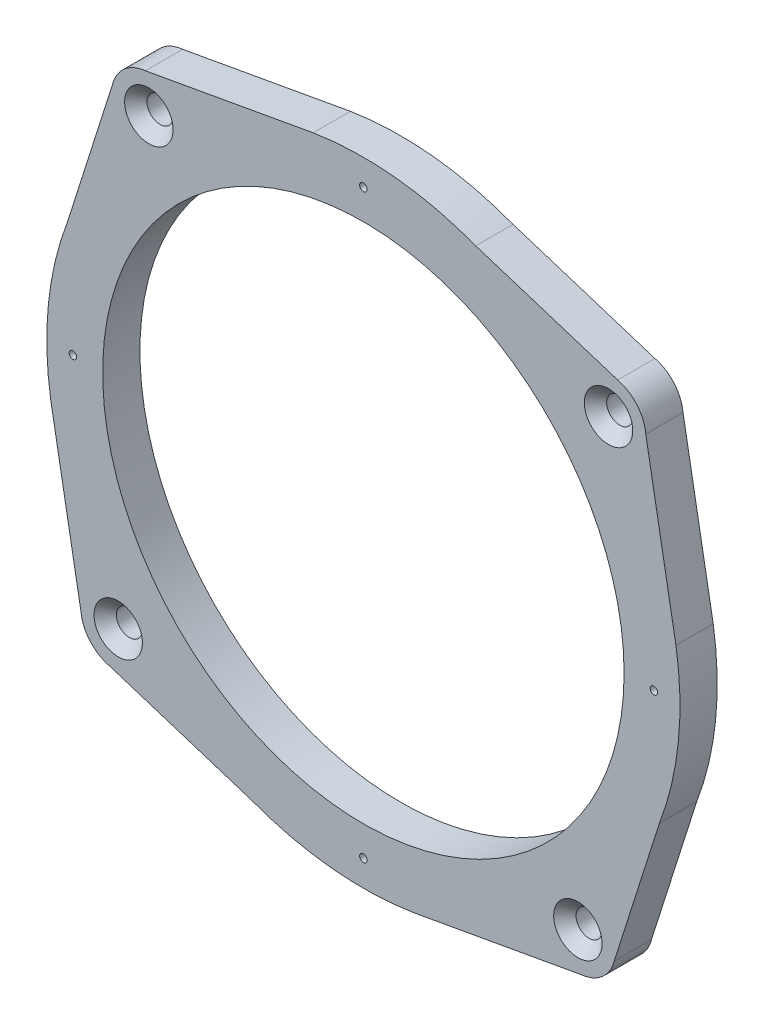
ISO-10303-21;
HEADER;
FILE_DESCRIPTION(('STEP AP214'),'2;1');
FILE_NAME('part.step','',(''),(''),'','','');
FILE_SCHEMA(('AUTOMOTIVE_DESIGN { 1 0 10303 214 1 1 1 1 }'));
ENDSEC;
DATA;
#1=APPLICATION_CONTEXT('core data for automotive mechanical design processes');
#2=APPLICATION_PROTOCOL_DEFINITION('international standard','automotive_design',2000,#1);
#3=PRODUCT_CONTEXT('',#1,'mechanical');
#4=PRODUCT('Part','Part','',(#3));
#5=PRODUCT_RELATED_PRODUCT_CATEGORY('part','',(#4));
#6=PRODUCT_DEFINITION_FORMATION('','',#4);
#7=PRODUCT_DEFINITION_CONTEXT('part definition',#1,'design');
#8=PRODUCT_DEFINITION('design','',#6,#7);
#9=PRODUCT_DEFINITION_SHAPE('','',#8);
#10=(LENGTH_UNIT() NAMED_UNIT(*) SI_UNIT(.MILLI.,.METRE.));
#11=(NAMED_UNIT(*) PLANE_ANGLE_UNIT() SI_UNIT($,.RADIAN.));
#12=(NAMED_UNIT(*) SI_UNIT($,.STERADIAN.) SOLID_ANGLE_UNIT());
#13=UNCERTAINTY_MEASURE_WITH_UNIT(LENGTH_MEASURE(1.E-05),#10,'distance_accuracy_value','');
#14=(GEOMETRIC_REPRESENTATION_CONTEXT(3) GLOBAL_UNCERTAINTY_ASSIGNED_CONTEXT((#13)) GLOBAL_UNIT_ASSIGNED_CONTEXT((#10,
#11,#12)) REPRESENTATION_CONTEXT('',''));
#15=CARTESIAN_POINT('',(0.,0.,0.));
#16=DIRECTION('',(0.,0.,1.));
#17=DIRECTION('',(1.,0.,0.));
#18=AXIS2_PLACEMENT_3D('',#15,#16,#17);
#19=CARTESIAN_POINT('',(533.734635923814,316.449701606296,10.));
#20=DIRECTION('',(0.,0.,-1.));
#21=DIRECTION('',(-1.,0.,0.));
#22=AXIS2_PLACEMENT_3D('',#19,#20,#21);
#23=CYLINDRICAL_SURFACE('',#22,85.0000000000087);
#24=CARTESIAN_POINT('',(533.734635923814,316.449701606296,0.));
#25=DIRECTION('',(0.,0.,1.));
#26=DIRECTION('',(1.,0.,0.));
#27=AXIS2_PLACEMENT_3D('',#24,#25,#26);
#28=CIRCLE('',#27,85.0000000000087);
#29=CARTESIAN_POINT('',(613.19653596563,286.270131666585,0.));
#30=VERTEX_POINT('',#29);
#31=CARTESIAN_POINT('',(617.658730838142,329.931032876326,0.));
#32=VERTEX_POINT('',#31);
#33=EDGE_CURVE('E217',#30,#32,#28,.T.);
#34=ORIENTED_EDGE('',*,*,#33,.T.);
#35=DIRECTION('',(0.,0.,-1.));
#36=VECTOR('',#35,1.);
#37=CARTESIAN_POINT('',(617.658730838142,329.931032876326,10.));
#38=LINE('',#37,#36);
#39=CARTESIAN_POINT('',(617.658730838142,329.931032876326,10.));
#40=VERTEX_POINT('',#39);
#41=EDGE_CURVE('E343',#40,#32,#38,.T.);
#42=ORIENTED_EDGE('',*,*,#41,.F.);
#43=CARTESIAN_POINT('',(533.734635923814,316.449701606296,10.));
#44=DIRECTION('',(0.,0.,1.));
#45=DIRECTION('',(1.,0.,0.));
#46=AXIS2_PLACEMENT_3D('',#43,#44,#45);
#47=CIRCLE('',#46,85.0000000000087);
#48=CARTESIAN_POINT('',(613.19653596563,286.270131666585,10.));
#49=VERTEX_POINT('',#48);
#50=EDGE_CURVE('E126',#49,#40,#47,.T.);
#51=ORIENTED_EDGE('',*,*,#50,.F.);
#52=DIRECTION('',(0.,0.,-1.));
#53=VECTOR('',#52,1.);
#54=CARTESIAN_POINT('',(613.19653596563,286.270131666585,10.));
#55=LINE('',#54,#53);
#56=EDGE_CURVE('E208',#49,#30,#55,.T.);
#57=ORIENTED_EDGE('',*,*,#56,.T.);
#58=EDGE_LOOP('',(#34,#42,#51,#57));
#59=FACE_BOUND('',#58,.T.);
#60=ADVANCED_FACE('F43',(#59),#23,.T.);
#61=CARTESIAN_POINT('',(655.77924584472,117.901952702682,10.));
#62=DIRECTION('',(0.984219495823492,0.17695192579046,0.));
#63=DIRECTION('',(-0.17695192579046,0.984219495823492,0.));
#64=AXIS2_PLACEMENT_3D('',#61,#62,#63);
#65=PLANE('',#64);
#66=DIRECTION('',(0.17695192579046,-0.984219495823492,0.));
#67=VECTOR('',#66,1.);
#68=CARTESIAN_POINT('',(655.77924584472,117.901952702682,0.));
#69=LINE('',#68,#67);
#70=CARTESIAN_POINT('',(609.5578781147,374.988565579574,0.));
#71=VERTEX_POINT('',#70);
#72=EDGE_CURVE('E221',#71,#32,#69,.T.);
#73=ORIENTED_EDGE('',*,*,#72,.F.);
#74=DIRECTION('',(0.,0.,-1.));
#75=VECTOR('',#74,1.);
#76=CARTESIAN_POINT('',(609.5578781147,374.988565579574,10.));
#77=LINE('',#76,#75);
#78=CARTESIAN_POINT('',(609.5578781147,374.988565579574,10.));
#79=VERTEX_POINT('',#78);
#80=EDGE_CURVE('E340',#79,#71,#77,.T.);
#81=ORIENTED_EDGE('',*,*,#80,.F.);
#82=DIRECTION('',(0.17695192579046,-0.984219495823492,0.));
#83=VECTOR('',#82,1.);
#84=CARTESIAN_POINT('',(655.77924584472,117.901952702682,10.));
#85=LINE('',#84,#83);
#86=EDGE_CURVE('E572',#79,#40,#85,.T.);
#87=ORIENTED_EDGE('',*,*,#86,.T.);
#88=ORIENTED_EDGE('',*,*,#41,.T.);
#89=EDGE_LOOP('',(#73,#81,#87,#88));
#90=FACE_BOUND('',#89,.T.);
#91=ADVANCED_FACE('F391',(#90),#65,.T.);
#92=CARTESIAN_POINT('',(599.554614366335,374.044755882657,10.));
#93=DIRECTION('',(0.,0.,-1.));
#94=DIRECTION('',(-1.,0.,0.));
#95=AXIS2_PLACEMENT_3D('',#92,#93,#94);
#96=CYLINDRICAL_SURFACE('',#95,10.0476894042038);
#97=CARTESIAN_POINT('',(599.554614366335,374.044755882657,0.));
#98=DIRECTION('',(0.,0.,1.));
#99=DIRECTION('',(1.,0.,0.));
#100=AXIS2_PLACEMENT_3D('',#97,#98,#99);
#101=CIRCLE('',#100,10.0476894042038);
#102=CARTESIAN_POINT('',(602.01723134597,383.785986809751,0.));
#103=VERTEX_POINT('',#102);
#104=EDGE_CURVE('E225',#71,#103,#101,.T.);
#105=ORIENTED_EDGE('',*,*,#104,.T.);
#106=DIRECTION('',(0.,0.,-1.));
#107=VECTOR('',#106,1.);
#108=CARTESIAN_POINT('',(602.01723134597,383.785986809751,10.));
#109=LINE('',#108,#107);
#110=CARTESIAN_POINT('',(602.01723134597,383.785986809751,10.));
#111=VERTEX_POINT('',#110);
#112=EDGE_CURVE('E336',#111,#103,#109,.T.);
#113=ORIENTED_EDGE('',*,*,#112,.F.);
#114=CARTESIAN_POINT('',(599.554614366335,374.044755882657,10.));
#115=DIRECTION('',(0.,0.,1.));
#116=DIRECTION('',(1.,0.,0.));
#117=AXIS2_PLACEMENT_3D('',#114,#115,#116);
#118=CIRCLE('',#117,10.0476894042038);
#119=EDGE_CURVE('E544',#79,#111,#118,.T.);
#120=ORIENTED_EDGE('',*,*,#119,.F.);
#121=ORIENTED_EDGE('',*,*,#80,.T.);
#122=EDGE_LOOP('',(#105,#113,#120,#121));
#123=FACE_BOUND('',#122,.T.);
#124=ADVANCED_FACE('F397',(#123),#96,.T.);
#125=CARTESIAN_POINT('',(166.262759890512,522.457150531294,10.));
#126=DIRECTION('',(-0.303247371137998,-0.952911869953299,0.));
#127=DIRECTION('',(0.952911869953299,-0.303247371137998,0.));
#128=AXIS2_PLACEMENT_3D('',#125,#126,#127);
#129=PLANE('',#128);
#130=DIRECTION('',(-0.952911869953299,0.303247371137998,0.));
#131=VECTOR('',#130,1.);
#132=CARTESIAN_POINT('',(166.262759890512,522.457150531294,0.));
#133=LINE('',#132,#131);
#134=CARTESIAN_POINT('',(563.914205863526,395.911601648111,0.));
#135=VERTEX_POINT('',#134);
#136=EDGE_CURVE('E228',#103,#135,#133,.T.);
#137=ORIENTED_EDGE('',*,*,#136,.T.);
#138=DIRECTION('',(0.,0.,-1.));
#139=VECTOR('',#138,1.);
#140=CARTESIAN_POINT('',(563.914205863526,395.911601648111,10.));
#141=LINE('',#140,#139);
#142=CARTESIAN_POINT('',(563.914205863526,395.911601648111,10.));
#143=VERTEX_POINT('',#142);
#144=EDGE_CURVE('E332',#143,#135,#141,.T.);
#145=ORIENTED_EDGE('',*,*,#144,.F.);
#146=DIRECTION('',(-0.952911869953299,0.303247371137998,0.));
#147=VECTOR('',#146,1.);
#148=CARTESIAN_POINT('',(166.262759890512,522.457150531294,10.));
#149=LINE('',#148,#147);
#150=EDGE_CURVE('E526',#111,#143,#149,.T.);
#151=ORIENTED_EDGE('',*,*,#150,.F.);
#152=ORIENTED_EDGE('',*,*,#112,.T.);
#153=EDGE_LOOP('',(#137,#145,#151,#152));
#154=FACE_BOUND('',#153,.T.);
#155=ADVANCED_FACE('F510',(#154),#129,.F.);
#156=CARTESIAN_POINT('',(533.734635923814,316.449701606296,10.));
#157=DIRECTION('',(0.,0.,-1.));
#158=DIRECTION('',(-1.,0.,0.));
#159=AXIS2_PLACEMENT_3D('',#156,#157,#158);
#160=CYLINDRICAL_SURFACE('',#159,85.0000000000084);
#161=CARTESIAN_POINT('',(533.734635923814,316.449701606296,0.));
#162=DIRECTION('',(0.,0.,1.));
#163=DIRECTION('',(1.,0.,0.));
#164=AXIS2_PLACEMENT_3D('',#161,#162,#163);
#165=CIRCLE('',#164,85.0000000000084);
#166=CARTESIAN_POINT('',(520.253304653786,400.373796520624,0.));
#167=VERTEX_POINT('',#166);
#168=EDGE_CURVE('E231',#135,#167,#165,.T.);
#169=ORIENTED_EDGE('',*,*,#168,.T.);
#170=DIRECTION('',(0.,0.,-1.));
#171=VECTOR('',#170,1.);
#172=CARTESIAN_POINT('',(520.253304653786,400.373796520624,10.));
#173=LINE('',#172,#171);
#174=CARTESIAN_POINT('',(520.253304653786,400.373796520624,10.));
#175=VERTEX_POINT('',#174);
#176=EDGE_CURVE('E329',#175,#167,#173,.T.);
#177=ORIENTED_EDGE('',*,*,#176,.F.);
#178=CARTESIAN_POINT('',(533.734635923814,316.449701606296,10.));
#179=DIRECTION('',(0.,0.,1.));
#180=DIRECTION('',(1.,0.,0.));
#181=AXIS2_PLACEMENT_3D('',#178,#179,#180);
#182=CIRCLE('',#181,85.0000000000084);
#183=EDGE_CURVE('E535',#143,#175,#182,.T.);
#184=ORIENTED_EDGE('',*,*,#183,.F.);
#185=ORIENTED_EDGE('',*,*,#144,.T.);
#186=EDGE_LOOP('',(#169,#177,#184,#185));
#187=FACE_BOUND('',#186,.T.);
#188=ADVANCED_FACE('F506',(#187),#160,.T.);
#189=CARTESIAN_POINT('',(-53.4387511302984,297.230224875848,10.));
#190=DIRECTION('',(-0.176951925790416,0.984219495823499,0.));
#191=DIRECTION('',(-0.984219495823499,-0.176951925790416,0.));
#192=AXIS2_PLACEMENT_3D('',#189,#190,#191);
#193=PLANE('',#192);
#194=DIRECTION('',(0.984219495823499,0.176951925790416,0.));
#195=VECTOR('',#194,1.);
#196=CARTESIAN_POINT('',(-53.4387511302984,297.230224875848,0.));
#197=LINE('',#196,#195);
#198=CARTESIAN_POINT('',(475.195771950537,392.272943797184,0.));
#199=VERTEX_POINT('',#198);
#200=EDGE_CURVE('E235',#199,#167,#197,.T.);
#201=ORIENTED_EDGE('',*,*,#200,.F.);
#202=DIRECTION('',(0.,0.,-1.));
#203=VECTOR('',#202,1.);
#204=CARTESIAN_POINT('',(475.195771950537,392.272943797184,10.));
#205=LINE('',#204,#203);
#206=CARTESIAN_POINT('',(475.195771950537,392.272943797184,10.));
#207=VERTEX_POINT('',#206);
#208=EDGE_CURVE('E326',#207,#199,#205,.T.);
#209=ORIENTED_EDGE('',*,*,#208,.F.);
#210=DIRECTION('',(0.984219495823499,0.176951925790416,0.));
#211=VECTOR('',#210,1.);
#212=CARTESIAN_POINT('',(-53.4387511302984,297.230224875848,10.));
#213=LINE('',#212,#211);
#214=EDGE_CURVE('E538',#207,#175,#213,.T.);
#215=ORIENTED_EDGE('',*,*,#214,.T.);
#216=ORIENTED_EDGE('',*,*,#176,.T.);
#217=EDGE_LOOP('',(#201,#209,#215,#216));
#218=FACE_BOUND('',#217,.T.);
#219=ADVANCED_FACE('F502',(#218),#193,.T.);
#220=CARTESIAN_POINT('',(476.139581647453,382.269680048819,10.));
#221=DIRECTION('',(0.,0.,-1.));
#222=DIRECTION('',(-1.,0.,0.));
#223=AXIS2_PLACEMENT_3D('',#220,#221,#222);
#224=CYLINDRICAL_SURFACE('',#223,10.047689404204);
#225=CARTESIAN_POINT('',(476.139581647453,382.269680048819,0.));
#226=DIRECTION('',(0.,0.,1.));
#227=DIRECTION('',(1.,0.,0.));
#228=AXIS2_PLACEMENT_3D('',#225,#226,#227);
#229=CIRCLE('',#228,10.047689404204);
#230=CARTESIAN_POINT('',(466.39835072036,384.732297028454,0.));
#231=VERTEX_POINT('',#230);
#232=EDGE_CURVE('E239',#199,#231,#229,.T.);
#233=ORIENTED_EDGE('',*,*,#232,.T.);
#234=DIRECTION('',(0.,0.,-1.));
#235=VECTOR('',#234,1.);
#236=CARTESIAN_POINT('',(466.39835072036,384.732297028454,10.));
#237=LINE('',#236,#235);
#238=CARTESIAN_POINT('',(466.39835072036,384.732297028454,10.));
#239=VERTEX_POINT('',#238);
#240=EDGE_CURVE('E322',#239,#231,#237,.T.);
#241=ORIENTED_EDGE('',*,*,#240,.F.);
#242=CARTESIAN_POINT('',(476.139581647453,382.269680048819,10.));
#243=DIRECTION('',(0.,0.,1.));
#244=DIRECTION('',(1.,0.,0.));
#245=AXIS2_PLACEMENT_3D('',#242,#243,#244);
#246=CIRCLE('',#245,10.047689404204);
#247=EDGE_CURVE('E542',#207,#239,#246,.T.);
#248=ORIENTED_EDGE('',*,*,#247,.F.);
#249=ORIENTED_EDGE('',*,*,#208,.T.);
#250=EDGE_LOOP('',(#233,#241,#248,#249));
#251=FACE_BOUND('',#250,.T.);
#252=ADVANCED_FACE('F498',(#251),#224,.T.);
#253=CARTESIAN_POINT('',(312.333509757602,-99.3946226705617,10.));
#254=DIRECTION('',(0.952911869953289,-0.303247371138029,0.));
#255=DIRECTION('',(0.303247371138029,0.952911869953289,0.));
#256=AXIS2_PLACEMENT_3D('',#253,#254,#255);
#257=PLANE('',#256);
#258=DIRECTION('',(-0.303247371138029,-0.952911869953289,0.));
#259=VECTOR('',#258,1.);
#260=CARTESIAN_POINT('',(312.333509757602,-99.3946226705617,0.));
#261=LINE('',#260,#259);
#262=CARTESIAN_POINT('',(454.272735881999,346.629271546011,0.));
#263=VERTEX_POINT('',#262);
#264=EDGE_CURVE('E242',#231,#263,#261,.T.);
#265=ORIENTED_EDGE('',*,*,#264,.T.);
#266=DIRECTION('',(0.,0.,-1.));
#267=VECTOR('',#266,1.);
#268=CARTESIAN_POINT('',(454.272735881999,346.629271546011,10.));
#269=LINE('',#268,#267);
#270=CARTESIAN_POINT('',(454.272735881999,346.629271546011,10.));
#271=VERTEX_POINT('',#270);
#272=EDGE_CURVE('E318',#271,#263,#269,.T.);
#273=ORIENTED_EDGE('',*,*,#272,.F.);
#274=DIRECTION('',(-0.303247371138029,-0.952911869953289,0.));
#275=VECTOR('',#274,1.);
#276=CARTESIAN_POINT('',(312.333509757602,-99.3946226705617,10.));
#277=LINE('',#276,#275);
#278=EDGE_CURVE('E550',#239,#271,#277,.T.);
#279=ORIENTED_EDGE('',*,*,#278,.F.);
#280=ORIENTED_EDGE('',*,*,#240,.T.);
#281=EDGE_LOOP('',(#265,#273,#279,#280));
#282=FACE_BOUND('',#281,.T.);
#283=ADVANCED_FACE('F494',(#282),#257,.F.);
#284=CARTESIAN_POINT('',(533.734635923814,316.449701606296,10.));
#285=DIRECTION('',(0.,0.,-1.));
#286=DIRECTION('',(-1.,0.,0.));
#287=AXIS2_PLACEMENT_3D('',#284,#285,#286);
#288=CYLINDRICAL_SURFACE('',#287,85.0000000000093);
#289=CARTESIAN_POINT('',(533.734635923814,316.449701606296,0.));
#290=DIRECTION('',(0.,0.,1.));
#291=DIRECTION('',(1.,0.,0.));
#292=AXIS2_PLACEMENT_3D('',#289,#290,#291);
#293=CIRCLE('',#292,85.0000000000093);
#294=CARTESIAN_POINT('',(449.810541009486,302.96837033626,0.));
#295=VERTEX_POINT('',#294);
#296=EDGE_CURVE('E245',#263,#295,#293,.T.);
#297=ORIENTED_EDGE('',*,*,#296,.T.);
#298=DIRECTION('',(0.,0.,-1.));
#299=VECTOR('',#298,1.);
#300=CARTESIAN_POINT('',(449.810541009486,302.96837033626,10.));
#301=LINE('',#300,#299);
#302=CARTESIAN_POINT('',(449.810541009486,302.96837033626,10.));
#303=VERTEX_POINT('',#302);
#304=EDGE_CURVE('E315',#303,#295,#301,.T.);
#305=ORIENTED_EDGE('',*,*,#304,.F.);
#306=CARTESIAN_POINT('',(533.734635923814,316.449701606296,10.));
#307=DIRECTION('',(0.,0.,1.));
#308=DIRECTION('',(1.,0.,0.));
#309=AXIS2_PLACEMENT_3D('',#306,#307,#308);
#310=CIRCLE('',#309,85.0000000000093);
#311=EDGE_CURVE('E553',#271,#303,#310,.T.);
#312=ORIENTED_EDGE('',*,*,#311,.F.);
#313=ORIENTED_EDGE('',*,*,#272,.T.);
#314=EDGE_LOOP('',(#297,#305,#312,#313));
#315=FACE_BOUND('',#314,.T.);
#316=ADVANCED_FACE('F490',(#315),#288,.T.);
#317=CARTESIAN_POINT('',(488.490911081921,87.8253355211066,10.));
#318=DIRECTION('',(-0.984219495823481,-0.17695192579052,0.));
#319=DIRECTION('',(0.17695192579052,-0.984219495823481,0.));
#320=AXIS2_PLACEMENT_3D('',#317,#318,#319);
#321=PLANE('',#320);
#322=DIRECTION('',(-0.17695192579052,0.984219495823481,0.));
#323=VECTOR('',#322,1.);
#324=CARTESIAN_POINT('',(488.490911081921,87.8253355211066,0.));
#325=LINE('',#324,#323);
#326=CARTESIAN_POINT('',(457.91139373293,257.910837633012,0.));
#327=VERTEX_POINT('',#326);
#328=EDGE_CURVE('E249',#327,#295,#325,.T.);
#329=ORIENTED_EDGE('',*,*,#328,.F.);
#330=DIRECTION('',(0.,0.,-1.));
#331=VECTOR('',#330,1.);
#332=CARTESIAN_POINT('',(457.91139373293,257.910837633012,10.));
#333=LINE('',#332,#331);
#334=CARTESIAN_POINT('',(457.91139373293,257.910837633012,10.));
#335=VERTEX_POINT('',#334);
#336=EDGE_CURVE('E312',#335,#327,#333,.T.);
#337=ORIENTED_EDGE('',*,*,#336,.F.);
#338=DIRECTION('',(-0.17695192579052,0.984219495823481,0.));
#339=VECTOR('',#338,1.);
#340=CARTESIAN_POINT('',(488.490911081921,87.8253355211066,10.));
#341=LINE('',#340,#339);
#342=EDGE_CURVE('E556',#335,#303,#341,.T.);
#343=ORIENTED_EDGE('',*,*,#342,.T.);
#344=ORIENTED_EDGE('',*,*,#304,.T.);
#345=EDGE_LOOP('',(#329,#337,#343,#344));
#346=FACE_BOUND('',#345,.T.);
#347=ADVANCED_FACE('F486',(#346),#321,.T.);
#348=CARTESIAN_POINT('',(467.914657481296,258.854647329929,10.));
#349=DIRECTION('',(0.,0.,-1.));
#350=DIRECTION('',(-1.,0.,0.));
#351=AXIS2_PLACEMENT_3D('',#348,#349,#350);
#352=CYLINDRICAL_SURFACE('',#351,10.0476894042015);
#353=CARTESIAN_POINT('',(467.914657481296,258.854647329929,0.));
#354=DIRECTION('',(0.,0.,1.));
#355=DIRECTION('',(1.,0.,0.));
#356=AXIS2_PLACEMENT_3D('',#353,#354,#355);
#357=CIRCLE('',#356,10.0476894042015);
#358=CARTESIAN_POINT('',(465.452040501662,249.11341640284,0.));
#359=VERTEX_POINT('',#358);
#360=EDGE_CURVE('E253',#327,#359,#357,.T.);
#361=ORIENTED_EDGE('',*,*,#360,.T.);
#362=DIRECTION('',(0.,0.,-1.));
#363=VECTOR('',#362,1.);
#364=CARTESIAN_POINT('',(465.452040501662,249.11341640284,10.));
#365=LINE('',#364,#363);
#366=CARTESIAN_POINT('',(465.452040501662,249.11341640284,10.));
#367=VERTEX_POINT('',#366);
#368=EDGE_CURVE('E308',#367,#359,#365,.T.);
#369=ORIENTED_EDGE('',*,*,#368,.F.);
#370=CARTESIAN_POINT('',(467.914657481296,258.854647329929,10.));
#371=DIRECTION('',(0.,0.,1.));
#372=DIRECTION('',(1.,0.,0.));
#373=AXIS2_PLACEMENT_3D('',#370,#371,#372);
#374=CIRCLE('',#373,10.0476894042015);
#375=EDGE_CURVE('E560',#335,#367,#374,.T.);
#376=ORIENTED_EDGE('',*,*,#375,.F.);
#377=ORIENTED_EDGE('',*,*,#336,.T.);
#378=EDGE_LOOP('',(#361,#369,#376,#377));
#379=FACE_BOUND('',#378,.T.);
#380=ADVANCED_FACE('F482',(#379),#352,.T.);
#381=CARTESIAN_POINT('',(114.788299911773,360.705958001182,10.));
#382=DIRECTION('',(0.30324737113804,0.952911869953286,0.));
#383=DIRECTION('',(-0.952911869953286,0.30324737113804,0.));
#384=AXIS2_PLACEMENT_3D('',#381,#382,#383);
#385=PLANE('',#384);
#386=DIRECTION('',(0.952911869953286,-0.30324737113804,0.));
#387=VECTOR('',#386,1.);
#388=CARTESIAN_POINT('',(114.788299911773,360.705958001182,0.));
#389=LINE('',#388,#387);
#390=CARTESIAN_POINT('',(503.555065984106,236.987801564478,0.));
#391=VERTEX_POINT('',#390);
#392=EDGE_CURVE('E256',#359,#391,#389,.T.);
#393=ORIENTED_EDGE('',*,*,#392,.T.);
#394=DIRECTION('',(0.,0.,-1.));
#395=VECTOR('',#394,1.);
#396=CARTESIAN_POINT('',(503.555065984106,236.987801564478,10.));
#397=LINE('',#396,#395);
#398=CARTESIAN_POINT('',(503.555065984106,236.987801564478,10.));
#399=VERTEX_POINT('',#398);
#400=EDGE_CURVE('E304',#399,#391,#397,.T.);
#401=ORIENTED_EDGE('',*,*,#400,.F.);
#402=DIRECTION('',(0.952911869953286,-0.30324737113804,0.));
#403=VECTOR('',#402,1.);
#404=CARTESIAN_POINT('',(114.788299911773,360.705958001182,10.));
#405=LINE('',#404,#403);
#406=EDGE_CURVE('E190',#367,#399,#405,.T.);
#407=ORIENTED_EDGE('',*,*,#406,.F.);
#408=ORIENTED_EDGE('',*,*,#368,.T.);
#409=EDGE_LOOP('',(#393,#401,#407,#408));
#410=FACE_BOUND('',#409,.T.);
#411=ADVANCED_FACE('F478',(#410),#385,.F.);
#412=CARTESIAN_POINT('',(533.734635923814,316.449701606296,10.));
#413=DIRECTION('',(0.,0.,-1.));
#414=DIRECTION('',(-1.,0.,0.));
#415=AXIS2_PLACEMENT_3D('',#412,#413,#414);
#416=CYLINDRICAL_SURFACE('',#415,85.0000000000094);
#417=CARTESIAN_POINT('',(533.734635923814,316.449701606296,0.));
#418=DIRECTION('',(0.,0.,1.));
#419=DIRECTION('',(1.,0.,0.));
#420=AXIS2_PLACEMENT_3D('',#417,#418,#419);
#421=CIRCLE('',#420,85.0000000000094);
#422=CARTESIAN_POINT('',(547.215967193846,232.525606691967,0.));
#423=VERTEX_POINT('',#422);
#424=EDGE_CURVE('E259',#391,#423,#421,.T.);
#425=ORIENTED_EDGE('',*,*,#424,.T.);
#426=DIRECTION('',(0.,0.,-1.));
#427=VECTOR('',#426,1.);
#428=CARTESIAN_POINT('',(547.215967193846,232.525606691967,10.));
#429=LINE('',#428,#427);
#430=CARTESIAN_POINT('',(547.215967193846,232.525606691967,10.));
#431=VERTEX_POINT('',#430);
#432=EDGE_CURVE('E175',#431,#423,#429,.T.);
#433=ORIENTED_EDGE('',*,*,#432,.F.);
#434=CARTESIAN_POINT('',(533.734635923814,316.449701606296,10.));
#435=DIRECTION('',(0.,0.,1.));
#436=DIRECTION('',(1.,0.,0.));
#437=AXIS2_PLACEMENT_3D('',#434,#435,#436);
#438=CIRCLE('',#437,85.0000000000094);
#439=EDGE_CURVE('E185',#399,#431,#438,.T.);
#440=ORIENTED_EDGE('',*,*,#439,.F.);
#441=ORIENTED_EDGE('',*,*,#400,.T.);
#442=EDGE_LOOP('',(#425,#433,#440,#441));
#443=FACE_BOUND('',#442,.T.);
#444=ADVANCED_FACE('F475',(#443),#416,.T.);
#445=CARTESIAN_POINT('',(-23.3621339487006,129.941890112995,10.));
#446=DIRECTION('',(0.176951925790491,-0.984219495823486,0.));
#447=DIRECTION('',(0.984219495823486,0.176951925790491,0.));
#448=AXIS2_PLACEMENT_3D('',#445,#446,#447);
#449=PLANE('',#448);
#450=DIRECTION('',(-0.984219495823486,-0.176951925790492,0.));
#451=VECTOR('',#450,1.);
#452=CARTESIAN_POINT('',(-23.3621339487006,129.941890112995,0.));
#453=LINE('',#452,#451);
#454=CARTESIAN_POINT('',(592.273499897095,240.626459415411,0.));
#455=VERTEX_POINT('',#454);
#456=EDGE_CURVE('E173',#455,#423,#453,.T.);
#457=ORIENTED_EDGE('',*,*,#456,.F.);
#458=DIRECTION('',(0.,0.,-1.));
#459=VECTOR('',#458,1.);
#460=CARTESIAN_POINT('',(592.273499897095,240.626459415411,10.));
#461=LINE('',#460,#459);
#462=CARTESIAN_POINT('',(592.273499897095,240.626459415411,10.));
#463=VERTEX_POINT('',#462);
#464=EDGE_CURVE('E167',#463,#455,#461,.T.);
#465=ORIENTED_EDGE('',*,*,#464,.F.);
#466=DIRECTION('',(-0.984219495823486,-0.176951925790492,0.));
#467=VECTOR('',#466,1.);
#468=CARTESIAN_POINT('',(-23.3621339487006,129.941890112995,10.));
#469=LINE('',#468,#467);
#470=EDGE_CURVE('E171',#463,#431,#469,.T.);
#471=ORIENTED_EDGE('',*,*,#470,.T.);
#472=ORIENTED_EDGE('',*,*,#432,.T.);
#473=EDGE_LOOP('',(#457,#465,#471,#472));
#474=FACE_BOUND('',#473,.T.);
#475=ADVANCED_FACE('F169',(#474),#449,.T.);
#476=CARTESIAN_POINT('',(591.329690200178,250.629723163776,10.));
#477=DIRECTION('',(0.,0.,-1.));
#478=DIRECTION('',(-1.,0.,0.));
#479=AXIS2_PLACEMENT_3D('',#476,#477,#478);
#480=CYLINDRICAL_SURFACE('',#479,10.0476894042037);
#481=CARTESIAN_POINT('',(591.329690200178,250.629723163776,0.));
#482=DIRECTION('',(0.,0.,1.));
#483=DIRECTION('',(1.,0.,0.));
#484=AXIS2_PLACEMENT_3D('',#481,#482,#483);
#485=CIRCLE('',#484,10.0476894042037);
#486=CARTESIAN_POINT('',(601.070921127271,248.167106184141,0.));
#487=VERTEX_POINT('',#486);
#488=EDGE_CURVE('E114',#455,#487,#485,.T.);
#489=ORIENTED_EDGE('',*,*,#488,.T.);
#490=DIRECTION('',(0.,0.,-1.));
#491=VECTOR('',#490,1.);
#492=CARTESIAN_POINT('',(601.070921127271,248.167106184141,10.));
#493=LINE('',#492,#491);
#494=CARTESIAN_POINT('',(601.070921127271,248.167106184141,10.));
#495=VERTEX_POINT('',#494);
#496=EDGE_CURVE('E176',#495,#487,#493,.T.);
#497=ORIENTED_EDGE('',*,*,#496,.F.);
#498=CARTESIAN_POINT('',(591.329690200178,250.629723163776,10.));
#499=DIRECTION('',(0.,0.,1.));
#500=DIRECTION('',(1.,0.,0.));
#501=AXIS2_PLACEMENT_3D('',#498,#499,#500);
#502=CIRCLE('',#501,10.0476894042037);
#503=EDGE_CURVE('E178',#463,#495,#502,.T.);
#504=ORIENTED_EDGE('',*,*,#503,.F.);
#505=ORIENTED_EDGE('',*,*,#464,.T.);
#506=EDGE_LOOP('',(#489,#497,#504,#505));
#507=FACE_BOUND('',#506,.T.);
#508=ADVANCED_FACE('F179',(#507),#480,.T.);
#509=CARTESIAN_POINT('',(591.329690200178,250.629723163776,10.));
#510=DIRECTION('',(0.,0.,-1.));
#511=DIRECTION('',(-1.,0.,0.));
#512=AXIS2_PLACEMENT_3D('',#509,#510,#511);
#513=CYLINDRICAL_SURFACE('',#512,3.49999999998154);
#514=CARTESIAN_POINT('',(591.329690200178,250.629723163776,7.00000000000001));
#515=DIRECTION('',(0.,0.,1.));
#516=DIRECTION('',(1.,0.,0.));
#517=AXIS2_PLACEMENT_3D('',#514,#515,#516);
#518=CIRCLE('',#517,3.49999999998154);
#519=CARTESIAN_POINT('',(594.829690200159,250.629723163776,7.00000000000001));
#520=VERTEX_POINT('',#519);
#521=EDGE_CURVE('E346',#520,#520,#518,.T.);
#522=ORIENTED_EDGE('',*,*,#521,.T.);
#523=EDGE_LOOP('',(#522));
#524=FACE_BOUND('',#523,.T.);
#525=CARTESIAN_POINT('',(591.329690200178,250.629723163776,0.));
#526=DIRECTION('',(0.,0.,1.));
#527=DIRECTION('',(1.,0.,0.));
#528=AXIS2_PLACEMENT_3D('',#525,#526,#527);
#529=CIRCLE('',#528,3.49999999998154);
#530=CARTESIAN_POINT('',(594.829690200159,250.629723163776,0.));
#531=VERTEX_POINT('',#530);
#532=EDGE_CURVE('E289',#531,#531,#529,.T.);
#533=ORIENTED_EDGE('',*,*,#532,.F.);
#534=EDGE_LOOP('',(#533));
#535=FACE_BOUND('',#534,.T.);
#536=ADVANCED_FACE('F433',(#524,#535),#513,.F.);
#537=CARTESIAN_POINT('',(476.139581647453,382.269680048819,10.));
#538=DIRECTION('',(0.,0.,-1.));
#539=DIRECTION('',(-1.,0.,0.));
#540=AXIS2_PLACEMENT_3D('',#537,#538,#539);
#541=CYLINDRICAL_SURFACE('',#540,3.50000000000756);
#542=CARTESIAN_POINT('',(476.139581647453,382.269680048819,6.99999999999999));
#543=DIRECTION('',(0.,0.,1.));
#544=DIRECTION('',(1.,0.,0.));
#545=AXIS2_PLACEMENT_3D('',#542,#543,#544);
#546=CIRCLE('',#545,3.50000000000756);
#547=CARTESIAN_POINT('',(479.639581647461,382.269680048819,6.99999999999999));
#548=VERTEX_POINT('',#547);
#549=EDGE_CURVE('E11',#548,#548,#546,.T.);
#550=ORIENTED_EDGE('',*,*,#549,.T.);
#551=EDGE_LOOP('',(#550));
#552=FACE_BOUND('',#551,.T.);
#553=CARTESIAN_POINT('',(476.139581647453,382.269680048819,0.));
#554=DIRECTION('',(0.,0.,1.));
#555=DIRECTION('',(1.,0.,0.));
#556=AXIS2_PLACEMENT_3D('',#553,#554,#555);
#557=CIRCLE('',#556,3.50000000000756);
#558=CARTESIAN_POINT('',(479.639581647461,382.269680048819,0.));
#559=VERTEX_POINT('',#558);
#560=EDGE_CURVE('E285',#559,#559,#557,.T.);
#561=ORIENTED_EDGE('',*,*,#560,.F.);
#562=EDGE_LOOP('',(#561));
#563=FACE_BOUND('',#562,.T.);
#564=ADVANCED_FACE('F436',(#552,#563),#541,.F.);
#565=CARTESIAN_POINT('',(467.914657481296,258.854647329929,10.));
#566=DIRECTION('',(0.,0.,-1.));
#567=DIRECTION('',(-1.,0.,0.));
#568=AXIS2_PLACEMENT_3D('',#565,#566,#567);
#569=CYLINDRICAL_SURFACE('',#568,3.49999999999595);
#570=CARTESIAN_POINT('',(467.914657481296,258.854647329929,6.99999999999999));
#571=DIRECTION('',(0.,0.,1.));
#572=DIRECTION('',(1.,0.,0.));
#573=AXIS2_PLACEMENT_3D('',#570,#571,#572);
#574=CIRCLE('',#573,3.49999999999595);
#575=CARTESIAN_POINT('',(471.414657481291,258.854647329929,6.99999999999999));
#576=VERTEX_POINT('',#575);
#577=EDGE_CURVE('E366',#576,#576,#574,.T.);
#578=ORIENTED_EDGE('',*,*,#577,.T.);
#579=EDGE_LOOP('',(#578));
#580=FACE_BOUND('',#579,.T.);
#581=CARTESIAN_POINT('',(467.914657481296,258.854647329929,0.));
#582=DIRECTION('',(0.,0.,1.));
#583=DIRECTION('',(1.,0.,0.));
#584=AXIS2_PLACEMENT_3D('',#581,#582,#583);
#585=CIRCLE('',#584,3.49999999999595);
#586=CARTESIAN_POINT('',(471.414657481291,258.854647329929,0.));
#587=VERTEX_POINT('',#586);
#588=EDGE_CURVE('E281',#587,#587,#585,.T.);
#589=ORIENTED_EDGE('',*,*,#588,.F.);
#590=EDGE_LOOP('',(#589));
#591=FACE_BOUND('',#590,.T.);
#592=ADVANCED_FACE('F452',(#580,#591),#569,.F.);
#593=CARTESIAN_POINT('',(533.734635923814,394.449701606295,10.));
#594=DIRECTION('',(0.,0.,-1.));
#595=DIRECTION('',(-1.,0.,0.));
#596=AXIS2_PLACEMENT_3D('',#593,#594,#595);
#597=CYLINDRICAL_SURFACE('',#596,1.00000000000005);
#598=CARTESIAN_POINT('',(533.734635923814,394.449701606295,10.));
#599=DIRECTION('',(0.,0.,1.));
#600=DIRECTION('',(1.,0.,0.));
#601=AXIS2_PLACEMENT_3D('',#598,#599,#600);
#602=CIRCLE('',#601,1.00000000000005);
#603=CARTESIAN_POINT('',(534.734635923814,394.449701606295,10.));
#604=VERTEX_POINT('',#603);
#605=EDGE_CURVE('E204',#604,#604,#602,.T.);
#606=ORIENTED_EDGE('',*,*,#605,.T.);
#607=EDGE_LOOP('',(#606));
#608=FACE_BOUND('',#607,.T.);
#609=CARTESIAN_POINT('',(533.734635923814,394.449701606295,0.));
#610=DIRECTION('',(0.,0.,1.));
#611=DIRECTION('',(1.,0.,0.));
#612=AXIS2_PLACEMENT_3D('',#609,#610,#611);
#613=CIRCLE('',#612,1.00000000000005);
#614=CARTESIAN_POINT('',(534.734635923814,394.449701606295,0.));
#615=VERTEX_POINT('',#614);
#616=EDGE_CURVE('E277',#615,#615,#613,.T.);
#617=ORIENTED_EDGE('',*,*,#616,.F.);
#618=EDGE_LOOP('',(#617));
#619=FACE_BOUND('',#618,.T.);
#620=ADVANCED_FACE('F456',(#608,#619),#597,.F.);
#621=CARTESIAN_POINT('',(533.734635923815,238.449701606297,10.));
#622=DIRECTION('',(0.,0.,-1.));
#623=DIRECTION('',(-1.,0.,0.));
#624=AXIS2_PLACEMENT_3D('',#621,#622,#623);
#625=CYLINDRICAL_SURFACE('',#624,1.00000000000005);
#626=CARTESIAN_POINT('',(533.734635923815,238.449701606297,10.));
#627=DIRECTION('',(0.,0.,1.));
#628=DIRECTION('',(1.,0.,0.));
#629=AXIS2_PLACEMENT_3D('',#626,#627,#628);
#630=CIRCLE('',#629,1.00000000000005);
#631=CARTESIAN_POINT('',(534.734635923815,238.449701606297,10.));
#632=VERTEX_POINT('',#631);
#633=EDGE_CURVE('E200',#632,#632,#630,.T.);
#634=ORIENTED_EDGE('',*,*,#633,.T.);
#635=EDGE_LOOP('',(#634));
#636=FACE_BOUND('',#635,.T.);
#637=CARTESIAN_POINT('',(533.734635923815,238.449701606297,0.));
#638=DIRECTION('',(0.,0.,1.));
#639=DIRECTION('',(1.,0.,0.));
#640=AXIS2_PLACEMENT_3D('',#637,#638,#639);
#641=CIRCLE('',#640,1.00000000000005);
#642=CARTESIAN_POINT('',(534.734635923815,238.449701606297,0.));
#643=VERTEX_POINT('',#642);
#644=EDGE_CURVE('E273',#643,#643,#641,.T.);
#645=ORIENTED_EDGE('',*,*,#644,.F.);
#646=EDGE_LOOP('',(#645));
#647=FACE_BOUND('',#646,.T.);
#648=ADVANCED_FACE('F460',(#636,#647),#625,.F.);
#649=CARTESIAN_POINT('',(455.734635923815,316.449701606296,10.));
#650=DIRECTION('',(0.,0.,-1.));
#651=DIRECTION('',(-1.,0.,0.));
#652=AXIS2_PLACEMENT_3D('',#649,#650,#651);
#653=CYLINDRICAL_SURFACE('',#652,1.00000000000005);
#654=CARTESIAN_POINT('',(455.734635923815,316.449701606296,10.));
#655=DIRECTION('',(0.,0.,1.));
#656=DIRECTION('',(1.,0.,0.));
#657=AXIS2_PLACEMENT_3D('',#654,#655,#656);
#658=CIRCLE('',#657,1.00000000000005);
#659=CARTESIAN_POINT('',(456.734635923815,316.449701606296,10.));
#660=VERTEX_POINT('',#659);
#661=EDGE_CURVE('E196',#660,#660,#658,.T.);
#662=ORIENTED_EDGE('',*,*,#661,.T.);
#663=EDGE_LOOP('',(#662));
#664=FACE_BOUND('',#663,.T.);
#665=CARTESIAN_POINT('',(455.734635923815,316.449701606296,0.));
#666=DIRECTION('',(0.,0.,1.));
#667=DIRECTION('',(1.,0.,0.));
#668=AXIS2_PLACEMENT_3D('',#665,#666,#667);
#669=CIRCLE('',#668,1.00000000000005);
#670=CARTESIAN_POINT('',(456.734635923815,316.449701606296,0.));
#671=VERTEX_POINT('',#670);
#672=EDGE_CURVE('E269',#671,#671,#669,.T.);
#673=ORIENTED_EDGE('',*,*,#672,.F.);
#674=EDGE_LOOP('',(#673));
#675=FACE_BOUND('',#674,.T.);
#676=ADVANCED_FACE('F464',(#664,#675),#653,.F.);
#677=CARTESIAN_POINT('',(474.084702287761,-150.869082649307,10.));
#678=DIRECTION('',(-0.952911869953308,0.30324737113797,0.));
#679=DIRECTION('',(-0.30324737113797,-0.952911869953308,0.));
#680=AXIS2_PLACEMENT_3D('',#677,#678,#679);
#681=PLANE('',#680);
#682=DIRECTION('',(0.303247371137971,0.952911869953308,0.));
#683=VECTOR('',#682,1.);
#684=CARTESIAN_POINT('',(474.084702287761,-150.869082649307,0.));
#685=LINE('',#684,#683);
#686=EDGE_CURVE('E120',#487,#30,#685,.T.);
#687=ORIENTED_EDGE('',*,*,#686,.T.);
#688=ORIENTED_EDGE('',*,*,#56,.F.);
#689=DIRECTION('',(0.303247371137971,0.952911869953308,0.));
#690=VECTOR('',#689,1.);
#691=CARTESIAN_POINT('',(474.084702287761,-150.869082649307,10.));
#692=LINE('',#691,#690);
#693=EDGE_CURVE('E62',#495,#49,#692,.T.);
#694=ORIENTED_EDGE('',*,*,#693,.F.);
#695=ORIENTED_EDGE('',*,*,#496,.T.);
#696=EDGE_LOOP('',(#687,#688,#694,#695));
#697=FACE_BOUND('',#696,.T.);
#698=ADVANCED_FACE('F406',(#697),#681,.F.);
#699=CARTESIAN_POINT('',(533.734635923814,316.449701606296,10.));
#700=DIRECTION('',(0.,0.,-1.));
#701=DIRECTION('',(-1.,0.,0.));
#702=AXIS2_PLACEMENT_3D('',#699,#700,#701);
#703=CYLINDRICAL_SURFACE('',#702,70.0000000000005);
#704=CARTESIAN_POINT('',(533.734635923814,316.449701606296,10.));
#705=DIRECTION('',(0.,0.,1.));
#706=DIRECTION('',(1.,0.,0.));
#707=AXIS2_PLACEMENT_3D('',#704,#705,#706);
#708=CIRCLE('',#707,70.0000000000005);
#709=CARTESIAN_POINT('',(603.734635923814,316.449701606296,10.));
#710=VERTEX_POINT('',#709);
#711=EDGE_CURVE('E573',#710,#710,#708,.T.);
#712=ORIENTED_EDGE('',*,*,#711,.T.);
#713=EDGE_LOOP('',(#712));
#714=FACE_BOUND('',#713,.T.);
#715=CARTESIAN_POINT('',(533.734635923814,316.449701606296,0.));
#716=DIRECTION('',(0.,0.,1.));
#717=DIRECTION('',(1.,0.,0.));
#718=AXIS2_PLACEMENT_3D('',#715,#716,#717);
#719=CIRCLE('',#718,70.0000000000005);
#720=CARTESIAN_POINT('',(603.734635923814,316.449701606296,0.));
#721=VERTEX_POINT('',#720);
#722=EDGE_CURVE('E213',#721,#721,#719,.T.);
#723=ORIENTED_EDGE('',*,*,#722,.F.);
#724=EDGE_LOOP('',(#723));
#725=FACE_BOUND('',#724,.T.);
#726=ADVANCED_FACE('F402',(#714,#725),#703,.F.);
#727=CARTESIAN_POINT('',(611.734635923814,316.449701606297,10.));
#728=DIRECTION('',(0.,0.,-1.));
#729=DIRECTION('',(-1.,0.,0.));
#730=AXIS2_PLACEMENT_3D('',#727,#728,#729);
#731=CYLINDRICAL_SURFACE('',#730,1.00000000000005);
#732=CARTESIAN_POINT('',(611.734635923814,316.449701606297,10.));
#733=DIRECTION('',(0.,0.,1.));
#734=DIRECTION('',(1.,0.,0.));
#735=AXIS2_PLACEMENT_3D('',#732,#733,#734);
#736=CIRCLE('',#735,1.00000000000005);
#737=CARTESIAN_POINT('',(612.734635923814,316.449701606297,10.));
#738=VERTEX_POINT('',#737);
#739=EDGE_CURVE('E297',#738,#738,#736,.T.);
#740=ORIENTED_EDGE('',*,*,#739,.T.);
#741=EDGE_LOOP('',(#740));
#742=FACE_BOUND('',#741,.T.);
#743=CARTESIAN_POINT('',(611.734635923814,316.449701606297,0.));
#744=DIRECTION('',(0.,0.,1.));
#745=DIRECTION('',(1.,0.,0.));
#746=AXIS2_PLACEMENT_3D('',#743,#744,#745);
#747=CIRCLE('',#746,1.00000000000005);
#748=CARTESIAN_POINT('',(612.734635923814,316.449701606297,0.));
#749=VERTEX_POINT('',#748);
#750=EDGE_CURVE('E209',#749,#749,#747,.T.);
#751=ORIENTED_EDGE('',*,*,#750,.F.);
#752=EDGE_LOOP('',(#751));
#753=FACE_BOUND('',#752,.T.);
#754=ADVANCED_FACE('F405',(#742,#753),#731,.F.);
#755=CARTESIAN_POINT('',(599.554614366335,374.044755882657,10.));
#756=DIRECTION('',(0.,0.,-1.));
#757=DIRECTION('',(-1.,0.,0.));
#758=AXIS2_PLACEMENT_3D('',#755,#756,#757);
#759=CYLINDRICAL_SURFACE('',#758,3.49999999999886);
#760=CARTESIAN_POINT('',(599.554614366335,374.044755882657,7.));
#761=DIRECTION('',(0.,0.,1.));
#762=DIRECTION('',(1.,0.,0.));
#763=AXIS2_PLACEMENT_3D('',#760,#761,#762);
#764=CIRCLE('',#763,3.49999999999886);
#765=CARTESIAN_POINT('',(603.054614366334,374.044755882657,7.));
#766=VERTEX_POINT('',#765);
#767=EDGE_CURVE('E54',#766,#766,#764,.T.);
#768=ORIENTED_EDGE('',*,*,#767,.T.);
#769=EDGE_LOOP('',(#768));
#770=FACE_BOUND('',#769,.T.);
#771=CARTESIAN_POINT('',(599.554614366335,374.044755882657,0.));
#772=DIRECTION('',(0.,0.,1.));
#773=DIRECTION('',(1.,0.,0.));
#774=AXIS2_PLACEMENT_3D('',#771,#772,#773);
#775=CIRCLE('',#774,3.49999999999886);
#776=CARTESIAN_POINT('',(603.054614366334,374.044755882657,0.));
#777=VERTEX_POINT('',#776);
#778=EDGE_CURVE('E293',#777,#777,#775,.T.);
#779=ORIENTED_EDGE('',*,*,#778,.F.);
#780=EDGE_LOOP('',(#779));
#781=FACE_BOUND('',#780,.T.);
#782=ADVANCED_FACE('F373',(#770,#781),#759,.F.);
#783=CARTESIAN_POINT('',(0.,0.,10.));
#784=DIRECTION('',(0.,0.,1.));
#785=DIRECTION('',(1.,0.,0.));
#786=AXIS2_PLACEMENT_3D('',#783,#784,#785);
#787=PLANE('',#786);
#788=CARTESIAN_POINT('',(591.329690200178,250.629723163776,10.));
#789=DIRECTION('',(0.,0.,1.));
#790=DIRECTION('',(1.,0.,0.));
#791=AXIS2_PLACEMENT_3D('',#788,#789,#790);
#792=CIRCLE('',#791,6.49999999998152);
#793=CARTESIAN_POINT('',(597.829690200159,250.629723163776,10.));
#794=VERTEX_POINT('',#793);
#795=EDGE_CURVE('E362',#794,#794,#792,.F.);
#796=ORIENTED_EDGE('',*,*,#795,.T.);
#797=EDGE_LOOP('',(#796));
#798=FACE_BOUND('',#797,.T.);
#799=CARTESIAN_POINT('',(467.914657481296,258.854647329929,10.));
#800=DIRECTION('',(0.,0.,1.));
#801=DIRECTION('',(1.,0.,0.));
#802=AXIS2_PLACEMENT_3D('',#799,#800,#801);
#803=CIRCLE('',#802,6.49999999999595);
#804=CARTESIAN_POINT('',(474.414657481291,258.854647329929,10.));
#805=VERTEX_POINT('',#804);
#806=EDGE_CURVE('E358',#805,#805,#803,.F.);
#807=ORIENTED_EDGE('',*,*,#806,.T.);
#808=EDGE_LOOP('',(#807));
#809=FACE_BOUND('',#808,.T.);
#810=CARTESIAN_POINT('',(599.554614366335,374.044755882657,10.));
#811=DIRECTION('',(0.,0.,1.));
#812=DIRECTION('',(1.,0.,0.));
#813=AXIS2_PLACEMENT_3D('',#810,#811,#812);
#814=CIRCLE('',#813,6.49999999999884);
#815=CARTESIAN_POINT('',(606.054614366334,374.044755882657,10.));
#816=VERTEX_POINT('',#815);
#817=EDGE_CURVE('E354',#816,#816,#814,.F.);
#818=ORIENTED_EDGE('',*,*,#817,.T.);
#819=EDGE_LOOP('',(#818));
#820=FACE_BOUND('',#819,.T.);
#821=CARTESIAN_POINT('',(476.139581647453,382.269680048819,10.));
#822=DIRECTION('',(0.,0.,1.));
#823=DIRECTION('',(1.,0.,0.));
#824=AXIS2_PLACEMENT_3D('',#821,#822,#823);
#825=CIRCLE('',#824,6.50000000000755);
#826=CARTESIAN_POINT('',(482.639581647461,382.269680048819,10.));
#827=VERTEX_POINT('',#826);
#828=EDGE_CURVE('E350',#827,#827,#825,.F.);
#829=ORIENTED_EDGE('',*,*,#828,.T.);
#830=EDGE_LOOP('',(#829));
#831=FACE_BOUND('',#830,.T.);
#832=ORIENTED_EDGE('',*,*,#739,.F.);
#833=EDGE_LOOP('',(#832));
#834=FACE_BOUND('',#833,.T.);
#835=ORIENTED_EDGE('',*,*,#711,.F.);
#836=EDGE_LOOP('',(#835));
#837=FACE_BOUND('',#836,.T.);
#838=ORIENTED_EDGE('',*,*,#50,.T.);
#839=ORIENTED_EDGE('',*,*,#86,.F.);
#840=ORIENTED_EDGE('',*,*,#119,.T.);
#841=ORIENTED_EDGE('',*,*,#150,.T.);
#842=ORIENTED_EDGE('',*,*,#183,.T.);
#843=ORIENTED_EDGE('',*,*,#214,.F.);
#844=ORIENTED_EDGE('',*,*,#247,.T.);
#845=ORIENTED_EDGE('',*,*,#278,.T.);
#846=ORIENTED_EDGE('',*,*,#311,.T.);
#847=ORIENTED_EDGE('',*,*,#342,.F.);
#848=ORIENTED_EDGE('',*,*,#375,.T.);
#849=ORIENTED_EDGE('',*,*,#406,.T.);
#850=ORIENTED_EDGE('',*,*,#439,.T.);
#851=ORIENTED_EDGE('',*,*,#470,.F.);
#852=ORIENTED_EDGE('',*,*,#503,.T.);
#853=ORIENTED_EDGE('',*,*,#693,.T.);
#854=EDGE_LOOP('',(#838,#839,#840,#841,#842,#843,#844,#845,#846,#847,#848,#849,#850,#851,#852,#853));
#855=FACE_BOUND('',#854,.T.);
#856=ORIENTED_EDGE('',*,*,#661,.F.);
#857=EDGE_LOOP('',(#856));
#858=FACE_BOUND('',#857,.T.);
#859=ORIENTED_EDGE('',*,*,#633,.F.);
#860=EDGE_LOOP('',(#859));
#861=FACE_BOUND('',#860,.T.);
#862=ORIENTED_EDGE('',*,*,#605,.F.);
#863=EDGE_LOOP('',(#862));
#864=FACE_BOUND('',#863,.T.);
#865=ADVANCED_FACE('F182',(#798,#809,#820,#831,#834,#837,#855,#858,#861,#864),#787,.T.);
#866=CARTESIAN_POINT('',(0.,0.,0.));
#867=DIRECTION('',(0.,0.,1.));
#868=DIRECTION('',(1.,0.,0.));
#869=AXIS2_PLACEMENT_3D('',#866,#867,#868);
#870=PLANE('',#869);
#871=ORIENTED_EDGE('',*,*,#750,.T.);
#872=EDGE_LOOP('',(#871));
#873=FACE_BOUND('',#872,.T.);
#874=ORIENTED_EDGE('',*,*,#722,.T.);
#875=EDGE_LOOP('',(#874));
#876=FACE_BOUND('',#875,.T.);
#877=ORIENTED_EDGE('',*,*,#33,.F.);
#878=ORIENTED_EDGE('',*,*,#686,.F.);
#879=ORIENTED_EDGE('',*,*,#488,.F.);
#880=ORIENTED_EDGE('',*,*,#456,.T.);
#881=ORIENTED_EDGE('',*,*,#424,.F.);
#882=ORIENTED_EDGE('',*,*,#392,.F.);
#883=ORIENTED_EDGE('',*,*,#360,.F.);
#884=ORIENTED_EDGE('',*,*,#328,.T.);
#885=ORIENTED_EDGE('',*,*,#296,.F.);
#886=ORIENTED_EDGE('',*,*,#264,.F.);
#887=ORIENTED_EDGE('',*,*,#232,.F.);
#888=ORIENTED_EDGE('',*,*,#200,.T.);
#889=ORIENTED_EDGE('',*,*,#168,.F.);
#890=ORIENTED_EDGE('',*,*,#136,.F.);
#891=ORIENTED_EDGE('',*,*,#104,.F.);
#892=ORIENTED_EDGE('',*,*,#72,.T.);
#893=EDGE_LOOP('',(#877,#878,#879,#880,#881,#882,#883,#884,#885,#886,#887,#888,#889,#890,#891,#892));
#894=FACE_BOUND('',#893,.T.);
#895=ORIENTED_EDGE('',*,*,#672,.T.);
#896=EDGE_LOOP('',(#895));
#897=FACE_BOUND('',#896,.T.);
#898=ORIENTED_EDGE('',*,*,#644,.T.);
#899=EDGE_LOOP('',(#898));
#900=FACE_BOUND('',#899,.T.);
#901=ORIENTED_EDGE('',*,*,#616,.T.);
#902=EDGE_LOOP('',(#901));
#903=FACE_BOUND('',#902,.T.);
#904=ORIENTED_EDGE('',*,*,#588,.T.);
#905=EDGE_LOOP('',(#904));
#906=FACE_BOUND('',#905,.T.);
#907=ORIENTED_EDGE('',*,*,#560,.T.);
#908=EDGE_LOOP('',(#907));
#909=FACE_BOUND('',#908,.T.);
#910=ORIENTED_EDGE('',*,*,#532,.T.);
#911=EDGE_LOOP('',(#910));
#912=FACE_BOUND('',#911,.T.);
#913=ORIENTED_EDGE('',*,*,#778,.T.);
#914=EDGE_LOOP('',(#913));
#915=FACE_BOUND('',#914,.T.);
#916=ADVANCED_FACE('F416',(#873,#876,#894,#897,#900,#903,#906,#909,#912,#915),#870,.F.);
#917=CARTESIAN_POINT('',(591.329690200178,250.629723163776,7.00000000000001));
#918=DIRECTION('',(0.,0.,1.));
#919=DIRECTION('',(1.,0.,0.));
#920=AXIS2_PLACEMENT_3D('',#917,#918,#919);
#921=CONICAL_SURFACE('',#920,3.49999999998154,0.785398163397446);
#922=ORIENTED_EDGE('',*,*,#795,.F.);
#923=EDGE_LOOP('',(#922));
#924=FACE_BOUND('',#923,.T.);
#925=ORIENTED_EDGE('',*,*,#521,.F.);
#926=EDGE_LOOP('',(#925));
#927=FACE_BOUND('',#926,.T.);
#928=ADVANCED_FACE('F385',(#924,#927),#921,.F.);
#929=CARTESIAN_POINT('',(467.914657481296,258.854647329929,6.99999999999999));
#930=DIRECTION('',(0.,0.,1.));
#931=DIRECTION('',(1.,0.,0.));
#932=AXIS2_PLACEMENT_3D('',#929,#930,#931);
#933=CONICAL_SURFACE('',#932,3.49999999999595,0.785398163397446);
#934=CARTESIAN_POINT('',(474.414657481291,258.854647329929,10.));
#935=CARTESIAN_POINT('',(474.383407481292,258.854647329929,9.96875));
#936=CARTESIAN_POINT('',(474.352157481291,258.854647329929,9.9375));
#937=CARTESIAN_POINT('',(474.289657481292,258.854647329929,9.875));
#938=CARTESIAN_POINT('',(474.258407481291,258.854647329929,9.84375));
#939=CARTESIAN_POINT('',(474.195907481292,258.854647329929,9.78125));
#940=CARTESIAN_POINT('',(474.164657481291,258.854647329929,9.75));
#941=CARTESIAN_POINT('',(474.102157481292,258.854647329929,9.6875));
#942=CARTESIAN_POINT('',(474.070907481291,258.854647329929,9.65625));
#943=CARTESIAN_POINT('',(474.008407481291,258.854647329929,9.59375));
#944=CARTESIAN_POINT('',(473.977157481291,258.854647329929,9.5625));
#945=CARTESIAN_POINT('',(473.914657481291,258.854647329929,9.5));
#946=CARTESIAN_POINT('',(473.883407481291,258.854647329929,9.46875));
#947=CARTESIAN_POINT('',(473.820907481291,258.854647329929,9.40625));
#948=CARTESIAN_POINT('',(473.789657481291,258.854647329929,9.37499999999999));
#949=CARTESIAN_POINT('',(473.727157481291,258.854647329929,9.3125));
#950=CARTESIAN_POINT('',(473.695907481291,258.854647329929,9.28125));
#951=CARTESIAN_POINT('',(473.633407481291,258.854647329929,9.21875));
#952=CARTESIAN_POINT('',(473.602157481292,258.854647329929,9.18749999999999));
#953=CARTESIAN_POINT('',(473.539657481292,258.854647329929,9.12499999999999));
#954=CARTESIAN_POINT('',(473.508407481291,258.854647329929,9.09374999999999));
#955=CARTESIAN_POINT('',(473.445907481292,258.854647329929,9.03125));
#956=CARTESIAN_POINT('',(473.414657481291,258.854647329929,9.));
#957=CARTESIAN_POINT('',(473.352157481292,258.854647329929,8.93749999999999));
#958=CARTESIAN_POINT('',(473.320907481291,258.854647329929,8.90624999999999));
#959=CARTESIAN_POINT('',(473.258407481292,258.854647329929,8.84374999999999));
#960=CARTESIAN_POINT('',(473.227157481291,258.854647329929,8.81249999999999));
#961=CARTESIAN_POINT('',(473.164657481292,258.854647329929,8.74999999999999));
#962=CARTESIAN_POINT('',(473.133407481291,258.854647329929,8.71874999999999));
#963=CARTESIAN_POINT('',(473.070907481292,258.854647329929,8.65624999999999));
#964=CARTESIAN_POINT('',(473.039657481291,258.854647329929,8.62499999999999));
#965=CARTESIAN_POINT('',(472.977157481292,258.854647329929,8.56249999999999));
#966=CARTESIAN_POINT('',(472.945907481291,258.854647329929,8.53124999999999));
#967=CARTESIAN_POINT('',(472.883407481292,258.854647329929,8.46874999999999));
#968=CARTESIAN_POINT('',(472.852157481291,258.854647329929,8.43749999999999));
#969=CARTESIAN_POINT('',(472.789657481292,258.854647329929,8.37499999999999));
#970=CARTESIAN_POINT('',(472.758407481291,258.854647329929,8.34374999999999));
#971=CARTESIAN_POINT('',(472.695907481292,258.854647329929,8.28124999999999));
#972=CARTESIAN_POINT('',(472.664657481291,258.854647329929,8.24999999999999));
#973=CARTESIAN_POINT('',(472.602157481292,258.854647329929,8.18749999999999));
#974=CARTESIAN_POINT('',(472.570907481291,258.854647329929,8.15624999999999));
#975=CARTESIAN_POINT('',(472.508407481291,258.854647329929,8.09374999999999));
#976=CARTESIAN_POINT('',(472.477157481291,258.854647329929,8.06249999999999));
#977=CARTESIAN_POINT('',(472.414657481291,258.854647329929,7.99999999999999));
#978=CARTESIAN_POINT('',(472.383407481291,258.854647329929,7.96874999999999));
#979=CARTESIAN_POINT('',(472.320907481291,258.854647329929,7.90624999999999));
#980=CARTESIAN_POINT('',(472.289657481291,258.854647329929,7.87499999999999));
#981=CARTESIAN_POINT('',(472.227157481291,258.854647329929,7.81249999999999));
#982=CARTESIAN_POINT('',(472.195907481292,258.854647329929,7.78124999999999));
#983=CARTESIAN_POINT('',(472.133407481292,258.854647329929,7.71874999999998));
#984=CARTESIAN_POINT('',(472.102157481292,258.854647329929,7.68749999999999));
#985=CARTESIAN_POINT('',(472.039657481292,258.854647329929,7.62499999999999));
#986=CARTESIAN_POINT('',(472.008407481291,258.854647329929,7.59374999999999));
#987=CARTESIAN_POINT('',(471.945907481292,258.854647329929,7.53124999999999));
#988=CARTESIAN_POINT('',(471.914657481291,258.854647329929,7.49999999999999));
#989=CARTESIAN_POINT('',(471.852157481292,258.854647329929,7.43749999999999));
#990=CARTESIAN_POINT('',(471.820907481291,258.854647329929,7.40624999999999));
#991=CARTESIAN_POINT('',(471.758407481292,258.854647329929,7.34374999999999));
#992=CARTESIAN_POINT('',(471.727157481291,258.854647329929,7.31249999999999));
#993=CARTESIAN_POINT('',(471.664657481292,258.854647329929,7.24999999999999));
#994=CARTESIAN_POINT('',(471.633407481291,258.854647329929,7.21874999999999));
#995=CARTESIAN_POINT('',(471.570907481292,258.854647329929,7.15624999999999));
#996=CARTESIAN_POINT('',(471.539657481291,258.854647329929,7.12499999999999));
#997=CARTESIAN_POINT('',(471.477157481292,258.854647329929,7.06249999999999));
#998=CARTESIAN_POINT('',(471.445907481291,258.854647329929,7.03124999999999));
#999=CARTESIAN_POINT('',(471.414657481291,258.854647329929,6.99999999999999));
#1000=B_SPLINE_CURVE_WITH_KNOTS('',3,(#934,#935,#936,#937,#938,#939,#940,#941,#942,#943,#944,
#945,#946,#947,#948,#949,#950,#951,#952,#953,#954,#955,#956,#957,#958,#959,#960,#961,#962,#963,
#964,#965,#966,#967,#968,#969,#970,#971,#972,#973,#974,#975,#976,#977,#978,#979,#980,#981,#982,
#983,#984,#985,#986,#987,#988,#989,#990,#991,#992,#993,#994,#995,#996,#997,#998,#999),
.UNSPECIFIED.,.F.,.F.,(4,2,2,2,2,2,2,2,2,2,2,2,2,2,2,2,2,2,2,2,2,2,2,2,2,2,2,2,2,2,2,2,4),(0.,
0.132582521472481,0.265165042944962,0.397747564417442,0.530330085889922,0.662912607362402,
0.795495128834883,0.928077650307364,1.06066017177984,1.19324269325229,1.32582521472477,
1.45840773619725,1.59099025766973,1.72357277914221,1.85615530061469,1.98873782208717,
2.12132034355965,2.25390286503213,2.38648538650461,2.51906790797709,2.65165042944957,
2.78423295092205,2.91681547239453,3.04939799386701,3.18198051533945,3.31456303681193,
3.44714555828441,3.5797280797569,3.71231060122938,3.84489312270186,3.97747564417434,
4.11005816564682,4.2426406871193),.UNSPECIFIED.);
#1001=EDGE_CURVE('BSEAM378',#805,#576,#1000,.T.);
#1002=ORIENTED_EDGE('',*,*,#806,.F.);
#1003=ORIENTED_EDGE('',*,*,#577,.F.);
#1004=ORIENTED_EDGE('',*,*,#1001,.T.);
#1005=ORIENTED_EDGE('',*,*,#1001,.F.);
#1006=EDGE_LOOP('',(#1002,#1004,#1003,#1005));
#1007=FACE_BOUND('',#1006,.T.);
#1008=ADVANCED_FACE('F378',(#1007),#933,.F.);
#1009=CARTESIAN_POINT('',(599.554614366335,374.044755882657,7.00000000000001));
#1010=DIRECTION('',(0.,0.,1.));
#1011=DIRECTION('',(1.,0.,0.));
#1012=AXIS2_PLACEMENT_3D('',#1009,#1010,#1011);
#1013=CONICAL_SURFACE('',#1012,3.49999999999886,0.785398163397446);
#1014=CARTESIAN_POINT('',(606.054614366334,374.044755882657,10.));
#1015=CARTESIAN_POINT('',(606.023364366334,374.044755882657,9.96875));
#1016=CARTESIAN_POINT('',(605.992114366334,374.044755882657,9.9375));
#1017=CARTESIAN_POINT('',(605.929614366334,374.044755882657,9.875));
#1018=CARTESIAN_POINT('',(605.898364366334,374.044755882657,9.84375));
#1019=CARTESIAN_POINT('',(605.835864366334,374.044755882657,9.78125));
#1020=CARTESIAN_POINT('',(605.804614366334,374.044755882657,9.75));
#1021=CARTESIAN_POINT('',(605.742114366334,374.044755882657,9.6875));
#1022=CARTESIAN_POINT('',(605.710864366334,374.044755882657,9.65625));
#1023=CARTESIAN_POINT('',(605.648364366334,374.044755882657,9.59375));
#1024=CARTESIAN_POINT('',(605.617114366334,374.044755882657,9.5625));
#1025=CARTESIAN_POINT('',(605.554614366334,374.044755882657,9.5));
#1026=CARTESIAN_POINT('',(605.523364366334,374.044755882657,9.46875));
#1027=CARTESIAN_POINT('',(605.460864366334,374.044755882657,9.40625));
#1028=CARTESIAN_POINT('',(605.429614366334,374.044755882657,9.375));
#1029=CARTESIAN_POINT('',(605.367114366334,374.044755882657,9.3125));
#1030=CARTESIAN_POINT('',(605.335864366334,374.044755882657,9.28125));
#1031=CARTESIAN_POINT('',(605.273364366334,374.044755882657,9.21875));
#1032=CARTESIAN_POINT('',(605.242114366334,374.044755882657,9.1875));
#1033=CARTESIAN_POINT('',(605.179614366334,374.044755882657,9.125));
#1034=CARTESIAN_POINT('',(605.148364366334,374.044755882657,9.09375));
#1035=CARTESIAN_POINT('',(605.085864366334,374.044755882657,9.03125));
#1036=CARTESIAN_POINT('',(605.054614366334,374.044755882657,9.));
#1037=CARTESIAN_POINT('',(604.992114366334,374.044755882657,8.9375));
#1038=CARTESIAN_POINT('',(604.960864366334,374.044755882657,8.90625));
#1039=CARTESIAN_POINT('',(604.898364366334,374.044755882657,8.84375));
#1040=CARTESIAN_POINT('',(604.867114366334,374.044755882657,8.81250000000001));
#1041=CARTESIAN_POINT('',(604.804614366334,374.044755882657,8.75000000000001));
#1042=CARTESIAN_POINT('',(604.773364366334,374.044755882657,8.71874999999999));
#1043=CARTESIAN_POINT('',(604.710864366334,374.044755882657,8.65624999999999));
#1044=CARTESIAN_POINT('',(604.679614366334,374.044755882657,8.625));
#1045=CARTESIAN_POINT('',(604.617114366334,374.044755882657,8.56250000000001));
#1046=CARTESIAN_POINT('',(604.585864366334,374.044755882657,8.53125));
#1047=CARTESIAN_POINT('',(604.523364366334,374.044755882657,8.46875));
#1048=CARTESIAN_POINT('',(604.492114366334,374.044755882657,8.4375));
#1049=CARTESIAN_POINT('',(604.429614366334,374.044755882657,8.375));
#1050=CARTESIAN_POINT('',(604.398364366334,374.044755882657,8.34375));
#1051=CARTESIAN_POINT('',(604.335864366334,374.044755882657,8.28125));
#1052=CARTESIAN_POINT('',(604.304614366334,374.044755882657,8.25));
#1053=CARTESIAN_POINT('',(604.242114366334,374.044755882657,8.1875));
#1054=CARTESIAN_POINT('',(604.210864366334,374.044755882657,8.15625));
#1055=CARTESIAN_POINT('',(604.148364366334,374.044755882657,8.09375));
#1056=CARTESIAN_POINT('',(604.117114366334,374.044755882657,8.0625));
#1057=CARTESIAN_POINT('',(604.054614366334,374.044755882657,8.));
#1058=CARTESIAN_POINT('',(604.023364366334,374.044755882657,7.96875));
#1059=CARTESIAN_POINT('',(603.960864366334,374.044755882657,7.90625));
#1060=CARTESIAN_POINT('',(603.929614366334,374.044755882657,7.875));
#1061=CARTESIAN_POINT('',(603.867114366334,374.044755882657,7.8125));
#1062=CARTESIAN_POINT('',(603.835864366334,374.044755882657,7.78125));
#1063=CARTESIAN_POINT('',(603.773364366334,374.044755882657,7.71875));
#1064=CARTESIAN_POINT('',(603.742114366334,374.044755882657,7.6875));
#1065=CARTESIAN_POINT('',(603.679614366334,374.044755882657,7.625));
#1066=CARTESIAN_POINT('',(603.648364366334,374.044755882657,7.59375));
#1067=CARTESIAN_POINT('',(603.585864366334,374.044755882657,7.53125));
#1068=CARTESIAN_POINT('',(603.554614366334,374.044755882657,7.5));
#1069=CARTESIAN_POINT('',(603.492114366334,374.044755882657,7.4375));
#1070=CARTESIAN_POINT('',(603.460864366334,374.044755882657,7.40625));
#1071=CARTESIAN_POINT('',(603.398364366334,374.044755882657,7.34375));
#1072=CARTESIAN_POINT('',(603.367114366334,374.044755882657,7.3125));
#1073=CARTESIAN_POINT('',(603.304614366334,374.044755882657,7.25));
#1074=CARTESIAN_POINT('',(603.273364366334,374.044755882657,7.21875));
#1075=CARTESIAN_POINT('',(603.210864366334,374.044755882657,7.15625));
#1076=CARTESIAN_POINT('',(603.179614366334,374.044755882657,7.125));
#1077=CARTESIAN_POINT('',(603.117114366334,374.044755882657,7.0625));
#1078=CARTESIAN_POINT('',(603.085864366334,374.044755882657,7.03125));
#1079=CARTESIAN_POINT('',(603.054614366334,374.044755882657,7.));
#1080=B_SPLINE_CURVE_WITH_KNOTS('',3,(#1014,#1015,#1016,#1017,#1018,#1019,#1020,#1021,#1022,
#1023,#1024,#1025,#1026,#1027,#1028,#1029,#1030,#1031,#1032,#1033,#1034,#1035,#1036,#1037,#1038,
#1039,#1040,#1041,#1042,#1043,#1044,#1045,#1046,#1047,#1048,#1049,#1050,#1051,#1052,#1053,#1054,
#1055,#1056,#1057,#1058,#1059,#1060,#1061,#1062,#1063,#1064,#1065,#1066,#1067,#1068,#1069,#1070,
#1071,#1072,#1073,#1074,#1075,#1076,#1077,#1078,#1079),.UNSPECIFIED.,.F.,.F.,(4,2,2,2,2,2,2,2,2,
2,2,2,2,2,2,2,2,2,2,2,2,2,2,2,2,2,2,2,2,2,2,2,4),(0.,0.13258252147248,0.26516504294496,
0.397747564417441,0.530330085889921,0.662912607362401,0.79549512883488,0.92807765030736,
1.06066017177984,1.19324269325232,1.3258252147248,1.45840773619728,1.59099025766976,
1.72357277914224,1.85615530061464,1.98873782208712,2.1213203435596,2.25390286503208,
2.38648538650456,2.51906790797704,2.65165042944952,2.784232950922,2.91681547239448,
3.04939799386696,3.18198051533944,3.31456303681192,3.4471455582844,3.57972807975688,
3.71231060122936,3.84489312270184,3.97747564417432,4.11005816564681,4.24264068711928),.UNSPECIFIED.);
#1081=EDGE_CURVE('BSEAM376',#816,#766,#1080,.T.);
#1082=ORIENTED_EDGE('',*,*,#817,.F.);
#1083=ORIENTED_EDGE('',*,*,#767,.F.);
#1084=ORIENTED_EDGE('',*,*,#1081,.T.);
#1085=ORIENTED_EDGE('',*,*,#1081,.F.);
#1086=EDGE_LOOP('',(#1082,#1084,#1083,#1085));
#1087=FACE_BOUND('',#1086,.T.);
#1088=ADVANCED_FACE('F376',(#1087),#1013,.F.);
#1089=CARTESIAN_POINT('',(476.139581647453,382.269680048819,6.99999999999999));
#1090=DIRECTION('',(0.,0.,1.));
#1091=DIRECTION('',(1.,0.,0.));
#1092=AXIS2_PLACEMENT_3D('',#1089,#1090,#1091);
#1093=CONICAL_SURFACE('',#1092,3.50000000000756,0.785398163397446);
#1094=ORIENTED_EDGE('',*,*,#828,.F.);
#1095=EDGE_LOOP('',(#1094));
#1096=FACE_BOUND('',#1095,.T.);
#1097=ORIENTED_EDGE('',*,*,#549,.F.);
#1098=EDGE_LOOP('',(#1097));
#1099=FACE_BOUND('',#1098,.T.);
#1100=ADVANCED_FACE('F46',(#1096,#1099),#1093,.F.);
#1101=CLOSED_SHELL('',(#60,#91,#124,#155,#188,#219,#252,#283,#316,#347,#380,#411,#444,#475,#508,
#536,#564,#592,#620,#648,#676,#698,#726,#754,#782,#865,#916,#928,#1008,#1088,#1100));
#1102=MANIFOLD_SOLID_BREP('B2',#1101);
#1103=ADVANCED_BREP_SHAPE_REPRESENTATION('',(#18,#1102),#14);
#1104=SHAPE_DEFINITION_REPRESENTATION(#9,#1103);
ENDSEC;
END-ISO-10303-21;
